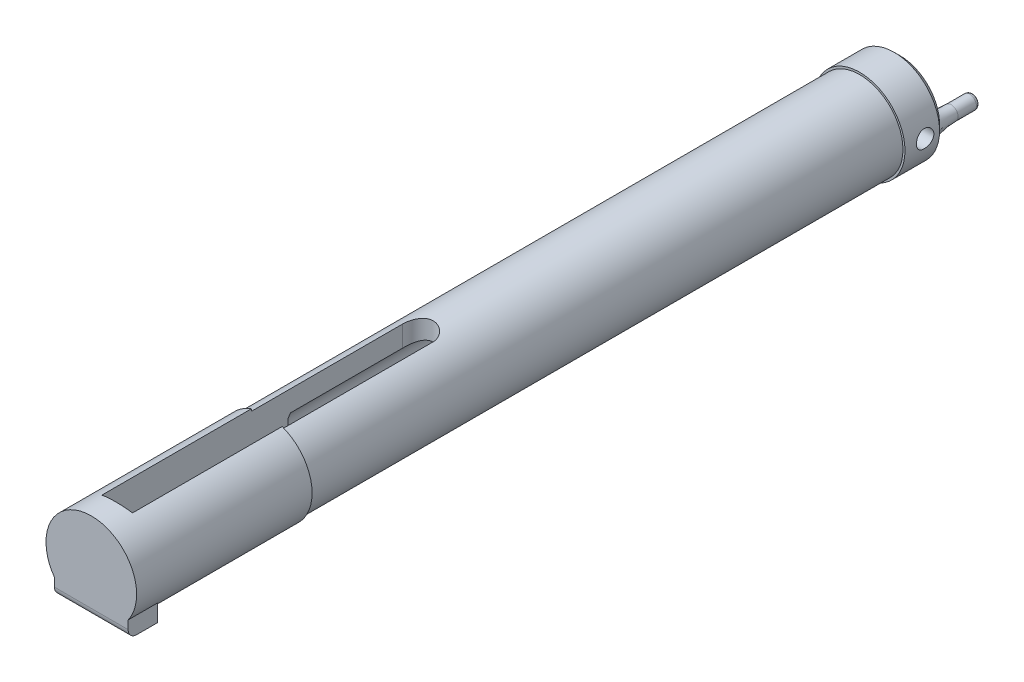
from build123d import *

# Parameters (mm, degrees)
CUT_EXTRUDE_1_DEPTH = 5.08
EXTRUDE_1_DEPTH     = 5.08
CUT_EXTRUDE_2_DEPTH = 11.43
CUT_EXTRUDE_3_DEPTH = 2.1209
SKETCH_6_R          = 1.20396
CUT_EXTRUDE_4_DEPTH = 7.2009
SKETCH_8_R          = 8.260928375
SKETCH_8_R_2        = 6.2484
SKETCH_8_R_3        = 3.429
CUT_EXTRUDE_5_DEPTH = 107.454849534


with BuildPart() as part:
    # Sketch 1 → Revolve 1 (revolve)
    with BuildSketch(Plane(origin=(0, 0, 0), x_dir=(0, 0, -1), z_dir=(1, 0, 0)), mode=Mode.PRIVATE) as revolve_1_sk:
        Polygon((-82.296, 0), (-82.296, 3.032125), (-81.899125, 3.429), (0, 3.429), (0, 5.45465), (-0.79375, 6.2484), (-5.55625, 6.2484), (-5.55625, 5.969), (-87.3125, 5.969), (-87.3125, 6.2484), (-111.506, 6.2484), (-111.506, 0), align=None)
    revolve(revolve_1_sk.sketch.rotate(Axis((0, 0, 107.974103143), (0, 0, -1)), 90), axis=Axis((0, 0, 107.974103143), (0, 0, -1)))

    # Sketch 3 → Cut-Extrude 1 (cut, symmetric)
    with BuildSketch(Plane(origin=(0, 0, 0), x_dir=(0, 0, -1), z_dir=(1, 0, 0))):
        with BuildLine():
            Line((-89.082776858, -6.2484), (-111.506, -6.2484))
            Line((-111.506, -6.2484), (-111.506, -4.7498))
            Line((-111.506, -4.7498), (-93.1799, -4.7498))
            ThreePointArc((-93.1799, -4.7498), (-90.998603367, -5.136206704), (-89.082776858, -6.2484))
        make_face()
    extrude(amount=CUT_EXTRUDE_1_DEPTH, both=True, mode=Mode.SUBTRACT)

    # Sketch 2 → Extrude 1 (add, symmetric)
    with BuildSketch(Plane(origin=(0, 0, 0), x_dir=(0, 0, -1), z_dir=(1, 0, 0))):
        with BuildLine():
            Line((-111.506, -2.346763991), (-107.4674, -2.346763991))
            Line((-107.4674, -2.346763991), (-107.4674, -5.9944))
            Line((-107.4674, -5.9944), (-110.315375, -5.9944))
            ThreePointArc((-110.315375, -5.9944), (-111.157274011, -5.645674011), (-111.506, -4.803775))
            Line((-111.506, -4.803775), (-111.506, -2.346763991))
        make_face()
    extrude(amount=EXTRUDE_1_DEPTH, both=True)

    # Sketch 4 → Cut-Extrude 2 (cut, symmetric)
    with BuildSketch(Plane(origin=(0, 0, 0), x_dir=(1, 0, 0), z_dir=(0, 1, 0))):
        with BuildLine():
            Line((2.1209, -66.4845), (2.1209, -106.2736))
            Line((2.1209, -106.2736), (-2.1209, -106.2736))
            Line((-2.1209, -106.2736), (-2.1209, -66.4845))
            ThreePointArc((-2.1209, -66.4845), (0, -64.3636), (2.1209, -66.4845))
        make_face()
    extrude(amount=CUT_EXTRUDE_2_DEPTH, both=True, mode=Mode.SUBTRACT)

    # Sketch 5 → Cut-Extrude 3 (cut, symmetric)
    with BuildSketch(Plane(origin=(0, 0, 0), x_dir=(0, 0, -1), z_dir=(1, 0, 0))):
        Polygon((-106.2736, 2.992837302), (-108.1532, 6.2484), (-106.2736, 6.2484), align=None)
    extrude(amount=CUT_EXTRUDE_3_DEPTH, both=True, mode=Mode.SUBTRACT)

    # Sketch 6 → Cut-Extrude 4 (cut, symmetric)
    with BuildSketch(Plane(origin=(0, 0, 0), x_dir=(0, 0, -1), z_dir=(1, 0, 0))):
        with Locations((-2.778125, 0)):
            Circle(SKETCH_6_R)
    extrude(amount=CUT_EXTRUDE_4_DEPTH, both=True, mode=Mode.SUBTRACT)

    # Sketch 7 → Revolve 2 (revolve)
    with BuildSketch(Plane(origin=(0, 0, 0), x_dir=(0, 0, -1), z_dir=(1, 0, 0)), mode=Mode.PRIVATE) as revolve_2_sk:
        with BuildLine():
            Line((9.595887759, -3.937), (7.0612, -3.937))
            ThreePointArc((7.0612, -3.937), (3.505922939, -3.429210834), (0.23495, -1.946449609))
            ThreePointArc((0.23495, -1.946449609), (0.062593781, -1.762361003), (0, -1.518071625))
            Line((0, -1.518071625), (-0.79375, -1.518071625))
            Line((-0.79375, -1.518071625), (-0.79375, -4.8895))
            Line((-0.79375, -4.8895), (10.2362, -4.8895))
            ThreePointArc((10.2362, -4.8895), (10.181307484, -4.512683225), (10.021192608, -4.1671875))
            ThreePointArc((10.021192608, -4.1671875), (9.837688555, -3.998237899), (9.595887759, -3.937))
        make_face()
    revolve(revolve_2_sk.sketch.rotate(Axis((0, -4.8895, 3.890405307), (0, 0, -1)), 90), axis=Axis((0, -4.8895, 3.890405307), (0, 0, -1)))

    # Sketch 8 → Cut-Extrude 5 (cut, through all)
    # profile 1 of 2: a face of its own
    with BuildSketch(Plane.XY.offset(5.55625)):
        Circle(SKETCH_8_R)
        Circle(SKETCH_8_R_2, mode=Mode.SUBTRACT)
    # profile 2 of 2: a face of its own
    with BuildSketch(Plane.XY.offset(5.55625)):
        with Locations(Location((0, 0, 0), (0, 0, 313.561203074))):
            Circle(SKETCH_8_R_3)
    extrude(amount=-CUT_EXTRUDE_5_DEPTH, mode=Mode.SUBTRACT)


solid = part.part
